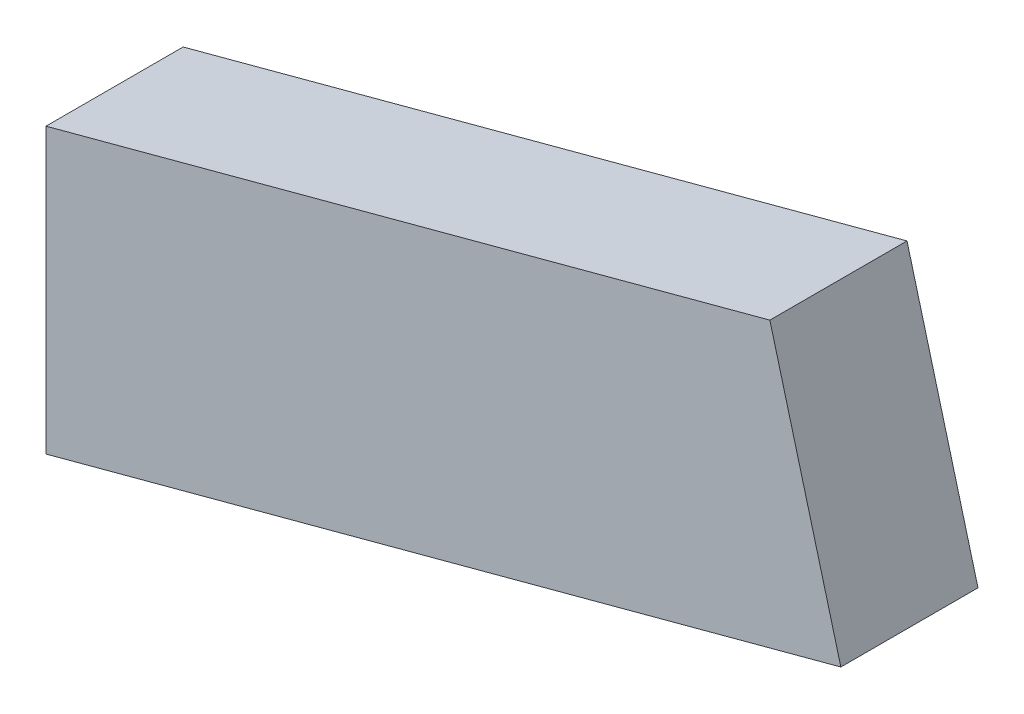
ISO-10303-21;
HEADER;
FILE_DESCRIPTION(('STEP AP214'),'2;1');
FILE_NAME('part.step','',(''),(''),'','','');
FILE_SCHEMA(('AUTOMOTIVE_DESIGN { 1 0 10303 214 1 1 1 1 }'));
ENDSEC;
DATA;
#1=APPLICATION_CONTEXT('core data for automotive mechanical design processes');
#2=APPLICATION_PROTOCOL_DEFINITION('international standard','automotive_design',2000,#1);
#3=PRODUCT_CONTEXT('',#1,'mechanical');
#4=PRODUCT('Part','Part','',(#3));
#5=PRODUCT_RELATED_PRODUCT_CATEGORY('part','',(#4));
#6=PRODUCT_DEFINITION_FORMATION('','',#4);
#7=PRODUCT_DEFINITION_CONTEXT('part definition',#1,'design');
#8=PRODUCT_DEFINITION('design','',#6,#7);
#9=PRODUCT_DEFINITION_SHAPE('','',#8);
#10=(LENGTH_UNIT() NAMED_UNIT(*) SI_UNIT(.MILLI.,.METRE.));
#11=(NAMED_UNIT(*) PLANE_ANGLE_UNIT() SI_UNIT($,.RADIAN.));
#12=(NAMED_UNIT(*) SI_UNIT($,.STERADIAN.) SOLID_ANGLE_UNIT());
#13=UNCERTAINTY_MEASURE_WITH_UNIT(LENGTH_MEASURE(1.E-05),#10,'distance_accuracy_value','');
#14=(GEOMETRIC_REPRESENTATION_CONTEXT(3) GLOBAL_UNCERTAINTY_ASSIGNED_CONTEXT((#13)) GLOBAL_UNIT_ASSIGNED_CONTEXT((#10,
#11,#12)) REPRESENTATION_CONTEXT('',''));
#15=CARTESIAN_POINT('',(0.,0.,0.));
#16=DIRECTION('',(0.,0.,1.));
#17=DIRECTION('',(1.,0.,0.));
#18=AXIS2_PLACEMENT_3D('',#15,#16,#17);
#19=CARTESIAN_POINT('',(0.,26.2960149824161,12.7));
#20=DIRECTION('',(1.,0.,0.));
#21=DIRECTION('',(0.,0.,-1.));
#22=AXIS2_PLACEMENT_3D('',#19,#20,#21);
#23=PLANE('',#22);
#24=DIRECTION('',(0.,-1.,0.));
#25=VECTOR('',#24,1.);
#26=CARTESIAN_POINT('',(0.,26.2960149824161,0.));
#27=LINE('',#26,#25);
#28=CARTESIAN_POINT('',(0.,26.2960149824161,0.));
#29=VERTEX_POINT('',#28);
#30=CARTESIAN_POINT('',(0.,0.,0.));
#31=VERTEX_POINT('',#30);
#32=EDGE_CURVE('E72',#29,#31,#27,.T.);
#33=ORIENTED_EDGE('',*,*,#32,.T.);
#34=DIRECTION('',(0.,0.,-1.));
#35=VECTOR('',#34,1.);
#36=CARTESIAN_POINT('',(0.,0.,12.7));
#37=LINE('',#36,#35);
#38=CARTESIAN_POINT('',(0.,0.,12.7));
#39=VERTEX_POINT('',#38);
#40=EDGE_CURVE('E11',#39,#31,#37,.T.);
#41=ORIENTED_EDGE('',*,*,#40,.F.);
#42=DIRECTION('',(0.,-1.,0.));
#43=VECTOR('',#42,1.);
#44=CARTESIAN_POINT('',(0.,26.2960149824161,12.7));
#45=LINE('',#44,#43);
#46=CARTESIAN_POINT('',(0.,26.2960149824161,12.7));
#47=VERTEX_POINT('',#46);
#48=EDGE_CURVE('E90',#47,#39,#45,.T.);
#49=ORIENTED_EDGE('',*,*,#48,.F.);
#50=DIRECTION('',(0.,0.,-1.));
#51=VECTOR('',#50,1.);
#52=CARTESIAN_POINT('',(0.,26.2960149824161,12.7));
#53=LINE('',#52,#51);
#54=EDGE_CURVE('E84',#47,#29,#53,.T.);
#55=ORIENTED_EDGE('',*,*,#54,.T.);
#56=EDGE_LOOP('',(#33,#41,#49,#55));
#57=FACE_BOUND('',#56,.T.);
#58=ADVANCED_FACE('F28',(#57),#23,.F.);
#59=CARTESIAN_POINT('',(0.,0.,12.7));
#60=DIRECTION('',(-0.258819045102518,0.965925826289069,0.));
#61=DIRECTION('',(-0.965925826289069,-0.258819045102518,0.));
#62=AXIS2_PLACEMENT_3D('',#59,#60,#61);
#63=PLANE('',#62);
#64=DIRECTION('',(0.965925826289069,0.258819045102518,0.));
#65=VECTOR('',#64,1.);
#66=CARTESIAN_POINT('',(0.,0.,0.));
#67=LINE('',#66,#65);
#68=CARTESIAN_POINT('',(73.6035479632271,19.7220112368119,0.));
#69=VERTEX_POINT('',#68);
#70=EDGE_CURVE('E68',#31,#69,#67,.T.);
#71=ORIENTED_EDGE('',*,*,#70,.T.);
#72=DIRECTION('',(0.,0.,-1.));
#73=VECTOR('',#72,1.);
#74=CARTESIAN_POINT('',(73.6035479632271,19.7220112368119,12.7));
#75=LINE('',#74,#73);
#76=CARTESIAN_POINT('',(73.6035479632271,19.7220112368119,12.7));
#77=VERTEX_POINT('',#76);
#78=EDGE_CURVE('E35',#77,#69,#75,.T.);
#79=ORIENTED_EDGE('',*,*,#78,.F.);
#80=DIRECTION('',(0.965925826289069,0.258819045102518,0.));
#81=VECTOR('',#80,1.);
#82=CARTESIAN_POINT('',(0.,0.,12.7));
#83=LINE('',#82,#81);
#84=EDGE_CURVE('E80',#39,#77,#83,.T.);
#85=ORIENTED_EDGE('',*,*,#84,.F.);
#86=ORIENTED_EDGE('',*,*,#40,.T.);
#87=EDGE_LOOP('',(#71,#79,#85,#86));
#88=FACE_BOUND('',#87,.T.);
#89=ADVANCED_FACE('F79',(#88),#63,.F.);
#90=CARTESIAN_POINT('',(73.6035479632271,19.7220112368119,12.7));
#91=DIRECTION('',(-0.965925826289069,-0.258819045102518,0.));
#92=DIRECTION('',(0.258819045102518,-0.965925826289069,0.));
#93=AXIS2_PLACEMENT_3D('',#90,#91,#92);
#94=PLANE('',#93);
#95=DIRECTION('',(-0.258819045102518,0.965925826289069,0.));
#96=VECTOR('',#95,1.);
#97=CARTESIAN_POINT('',(73.6035479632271,19.7220112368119,0.));
#98=LINE('',#97,#96);
#99=CARTESIAN_POINT('',(67.0295442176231,44.2565272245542,0.));
#100=VERTEX_POINT('',#99);
#101=EDGE_CURVE('E73',#69,#100,#98,.T.);
#102=ORIENTED_EDGE('',*,*,#101,.T.);
#103=DIRECTION('',(0.,0.,-1.));
#104=VECTOR('',#103,1.);
#105=CARTESIAN_POINT('',(67.0295442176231,44.2565272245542,12.7));
#106=LINE('',#105,#104);
#107=CARTESIAN_POINT('',(67.0295442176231,44.2565272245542,12.7));
#108=VERTEX_POINT('',#107);
#109=EDGE_CURVE('E96',#108,#100,#106,.T.);
#110=ORIENTED_EDGE('',*,*,#109,.F.);
#111=DIRECTION('',(-0.258819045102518,0.965925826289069,0.));
#112=VECTOR('',#111,1.);
#113=CARTESIAN_POINT('',(73.6035479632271,19.7220112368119,12.7));
#114=LINE('',#113,#112);
#115=EDGE_CURVE('E47',#77,#108,#114,.T.);
#116=ORIENTED_EDGE('',*,*,#115,.F.);
#117=ORIENTED_EDGE('',*,*,#78,.T.);
#118=EDGE_LOOP('',(#102,#110,#116,#117));
#119=FACE_BOUND('',#118,.T.);
#120=ADVANCED_FACE('F99',(#119),#94,.F.);
#121=CARTESIAN_POINT('',(67.0295442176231,44.2565272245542,12.7));
#122=DIRECTION('',(0.258819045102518,-0.965925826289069,0.));
#123=DIRECTION('',(0.965925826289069,0.258819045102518,0.));
#124=AXIS2_PLACEMENT_3D('',#121,#122,#123);
#125=PLANE('',#124);
#126=DIRECTION('',(-0.965925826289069,-0.258819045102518,0.));
#127=VECTOR('',#126,1.);
#128=CARTESIAN_POINT('',(67.0295442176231,44.2565272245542,0.));
#129=LINE('',#128,#127);
#130=EDGE_CURVE('E88',#100,#29,#129,.T.);
#131=ORIENTED_EDGE('',*,*,#130,.T.);
#132=ORIENTED_EDGE('',*,*,#54,.F.);
#133=DIRECTION('',(-0.965925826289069,-0.258819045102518,0.));
#134=VECTOR('',#133,1.);
#135=CARTESIAN_POINT('',(67.0295442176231,44.2565272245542,12.7));
#136=LINE('',#135,#134);
#137=EDGE_CURVE('E42',#108,#47,#136,.T.);
#138=ORIENTED_EDGE('',*,*,#137,.F.);
#139=ORIENTED_EDGE('',*,*,#109,.T.);
#140=EDGE_LOOP('',(#131,#132,#138,#139));
#141=FACE_BOUND('',#140,.T.);
#142=ADVANCED_FACE('F101',(#141),#125,.F.);
#143=CARTESIAN_POINT('',(0.,26.2960149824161,12.7));
#144=DIRECTION('',(0.,0.,-1.));
#145=DIRECTION('',(-1.,0.,0.));
#146=AXIS2_PLACEMENT_3D('',#143,#144,#145);
#147=PLANE('',#146);
#148=ORIENTED_EDGE('',*,*,#48,.T.);
#149=ORIENTED_EDGE('',*,*,#84,.T.);
#150=ORIENTED_EDGE('',*,*,#115,.T.);
#151=ORIENTED_EDGE('',*,*,#137,.T.);
#152=EDGE_LOOP('',(#148,#149,#150,#151));
#153=FACE_BOUND('',#152,.T.);
#154=ADVANCED_FACE('F102',(#153),#147,.F.);
#155=CARTESIAN_POINT('',(0.,26.2960149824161,0.));
#156=DIRECTION('',(0.,0.,-1.));
#157=DIRECTION('',(-1.,0.,0.));
#158=AXIS2_PLACEMENT_3D('',#155,#156,#157);
#159=PLANE('',#158);
#160=ORIENTED_EDGE('',*,*,#32,.F.);
#161=ORIENTED_EDGE('',*,*,#130,.F.);
#162=ORIENTED_EDGE('',*,*,#101,.F.);
#163=ORIENTED_EDGE('',*,*,#70,.F.);
#164=EDGE_LOOP('',(#160,#161,#162,#163));
#165=FACE_BOUND('',#164,.T.);
#166=ADVANCED_FACE('F69',(#165),#159,.T.);
#167=CLOSED_SHELL('',(#58,#89,#120,#142,#154,#166));
#168=MANIFOLD_SOLID_BREP('B2',#167);
#169=ADVANCED_BREP_SHAPE_REPRESENTATION('',(#18,#168),#14);
#170=SHAPE_DEFINITION_REPRESENTATION(#9,#169);
ENDSEC;
END-ISO-10303-21;
